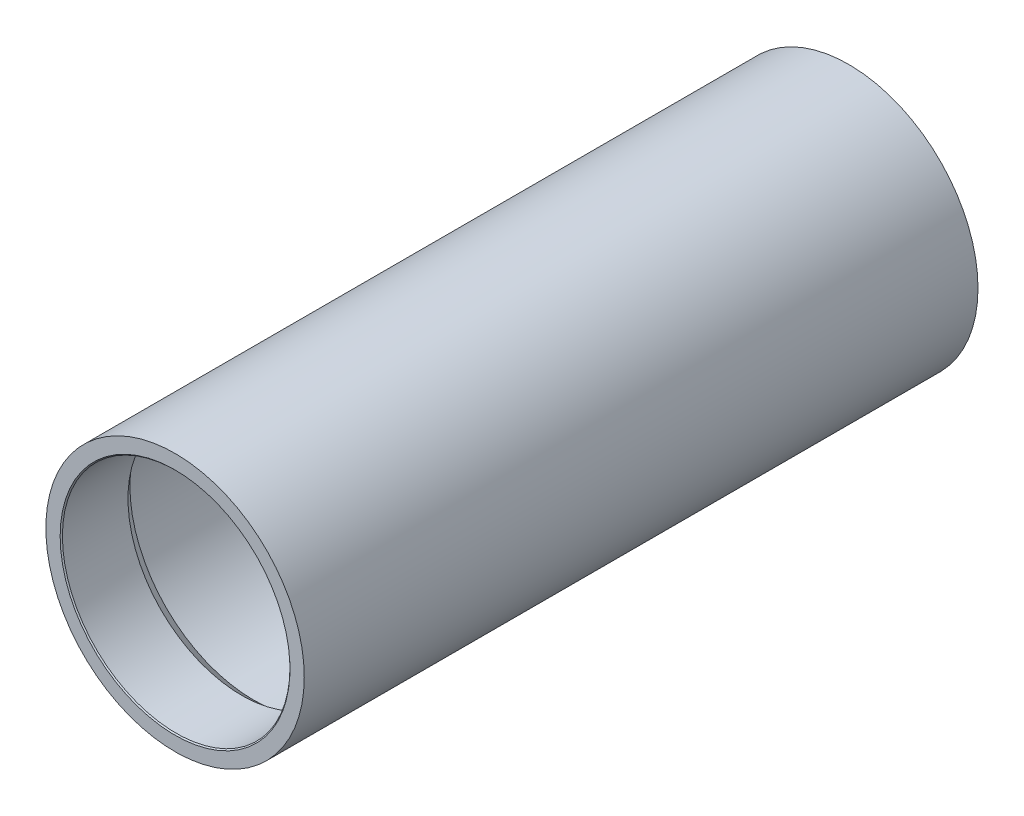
ISO-10303-21;
HEADER;
FILE_DESCRIPTION(('STEP AP214'),'2;1');
FILE_NAME('part.step','',(''),(''),'','','');
FILE_SCHEMA(('AUTOMOTIVE_DESIGN { 1 0 10303 214 1 1 1 1 }'));
ENDSEC;
DATA;
#1=APPLICATION_CONTEXT('core data for automotive mechanical design processes');
#2=APPLICATION_PROTOCOL_DEFINITION('international standard','automotive_design',2000,#1);
#3=PRODUCT_CONTEXT('',#1,'mechanical');
#4=PRODUCT('Part','Part','',(#3));
#5=PRODUCT_RELATED_PRODUCT_CATEGORY('part','',(#4));
#6=PRODUCT_DEFINITION_FORMATION('','',#4);
#7=PRODUCT_DEFINITION_CONTEXT('part definition',#1,'design');
#8=PRODUCT_DEFINITION('design','',#6,#7);
#9=PRODUCT_DEFINITION_SHAPE('','',#8);
#10=(LENGTH_UNIT() NAMED_UNIT(*) SI_UNIT(.MILLI.,.METRE.));
#11=(NAMED_UNIT(*) PLANE_ANGLE_UNIT() SI_UNIT($,.RADIAN.));
#12=(NAMED_UNIT(*) SI_UNIT($,.STERADIAN.) SOLID_ANGLE_UNIT());
#13=UNCERTAINTY_MEASURE_WITH_UNIT(LENGTH_MEASURE(1.E-05),#10,'distance_accuracy_value','');
#14=(GEOMETRIC_REPRESENTATION_CONTEXT(3) GLOBAL_UNCERTAINTY_ASSIGNED_CONTEXT((#13)) GLOBAL_UNIT_ASSIGNED_CONTEXT((#10,
#11,#12)) REPRESENTATION_CONTEXT('',''));
#15=CARTESIAN_POINT('',(0.,0.,0.));
#16=DIRECTION('',(0.,0.,1.));
#17=DIRECTION('',(1.,0.,0.));
#18=AXIS2_PLACEMENT_3D('',#15,#16,#17);
#19=CARTESIAN_POINT('',(0.,0.,0.));
#20=DIRECTION('',(0.,0.,1.));
#21=DIRECTION('',(1.,0.,0.));
#22=AXIS2_PLACEMENT_3D('',#19,#20,#21);
#23=CYLINDRICAL_SURFACE('',#22,57.15);
#24=CARTESIAN_POINT('',(0.,0.,0.));
#25=DIRECTION('',(0.,0.,1.));
#26=DIRECTION('',(1.,0.,0.));
#27=AXIS2_PLACEMENT_3D('',#24,#25,#26);
#28=CIRCLE('',#27,57.15);
#29=CARTESIAN_POINT('',(57.15,0.,0.));
#30=VERTEX_POINT('',#29);
#31=EDGE_CURVE('E59',#30,#30,#28,.T.);
#32=ORIENTED_EDGE('',*,*,#31,.F.);
#33=EDGE_LOOP('',(#32));
#34=FACE_BOUND('',#33,.T.);
#35=CARTESIAN_POINT('',(0.,0.,-298.));
#36=DIRECTION('',(0.,0.,1.));
#37=DIRECTION('',(1.,0.,0.));
#38=AXIS2_PLACEMENT_3D('',#35,#36,#37);
#39=CIRCLE('',#38,57.15);
#40=CARTESIAN_POINT('',(57.15,0.,-298.));
#41=VERTEX_POINT('',#40);
#42=EDGE_CURVE('E78',#41,#41,#39,.T.);
#43=ORIENTED_EDGE('',*,*,#42,.T.);
#44=EDGE_LOOP('',(#43));
#45=FACE_BOUND('',#44,.T.);
#46=ADVANCED_FACE('F34',(#34,#45),#23,.T.);
#47=CARTESIAN_POINT('',(0.,57.15,0.));
#48=DIRECTION('',(0.,0.,-1.));
#49=DIRECTION('',(-1.,0.,0.));
#50=AXIS2_PLACEMENT_3D('',#47,#48,#49);
#51=PLANE('',#50);
#52=CARTESIAN_POINT('',(0.,0.,0.));
#53=DIRECTION('',(0.,0.,-1.));
#54=DIRECTION('',(-1.,0.,0.));
#55=AXIS2_PLACEMENT_3D('',#52,#53,#54);
#56=CIRCLE('',#55,50.825);
#57=CARTESIAN_POINT('',(-50.825,0.,0.));
#58=VERTEX_POINT('',#57);
#59=EDGE_CURVE('E10',#58,#58,#56,.T.);
#60=ORIENTED_EDGE('',*,*,#59,.T.);
#61=EDGE_LOOP('',(#60));
#62=FACE_BOUND('',#61,.T.);
#63=ORIENTED_EDGE('',*,*,#31,.T.);
#64=EDGE_LOOP('',(#63));
#65=FACE_BOUND('',#64,.T.);
#66=ADVANCED_FACE('F99',(#62,#65),#51,.F.);
#67=CARTESIAN_POINT('',(0.,0.,0.));
#68=DIRECTION('',(0.,0.,1.));
#69=DIRECTION('',(1.,0.,0.));
#70=AXIS2_PLACEMENT_3D('',#67,#68,#69);
#71=CYLINDRICAL_SURFACE('',#70,50.325);
#72=CARTESIAN_POINT('',(0.,0.,-0.500000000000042));
#73=DIRECTION('',(0.,0.,-1.));
#74=DIRECTION('',(-1.,0.,0.));
#75=AXIS2_PLACEMENT_3D('',#72,#73,#74);
#76=CIRCLE('',#75,50.325);
#77=CARTESIAN_POINT('',(-50.325,0.,-0.500000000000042));
#78=VERTEX_POINT('',#77);
#79=EDGE_CURVE('E42',#78,#78,#76,.F.);
#80=ORIENTED_EDGE('',*,*,#79,.T.);
#81=EDGE_LOOP('',(#80));
#82=FACE_BOUND('',#81,.T.);
#83=CARTESIAN_POINT('',(0.,0.,-29.5));
#84=DIRECTION('',(0.,0.,1.));
#85=DIRECTION('',(1.,0.,0.));
#86=AXIS2_PLACEMENT_3D('',#83,#84,#85);
#87=CIRCLE('',#86,50.325);
#88=CARTESIAN_POINT('',(50.325,0.,-29.5));
#89=VERTEX_POINT('',#88);
#90=EDGE_CURVE('E63',#89,#89,#87,.T.);
#91=ORIENTED_EDGE('',*,*,#90,.F.);
#92=EDGE_LOOP('',(#91));
#93=FACE_BOUND('',#92,.T.);
#94=ADVANCED_FACE('F105',(#82,#93),#71,.F.);
#95=CARTESIAN_POINT('',(0.,0.,-29.5));
#96=DIRECTION('',(0.,0.,-1.));
#97=DIRECTION('',(-1.,0.,0.));
#98=AXIS2_PLACEMENT_3D('',#95,#96,#97);
#99=CONICAL_SURFACE('',#98,50.325,0.698131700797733);
#100=CARTESIAN_POINT('',(0.,0.,-34.7735096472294));
#101=DIRECTION('',(0.,0.,1.));
#102=DIRECTION('',(1.,0.,0.));
#103=AXIS2_PLACEMENT_3D('',#100,#101,#102);
#104=CIRCLE('',#103,54.75);
#105=CARTESIAN_POINT('',(54.75,0.,-34.7735096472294));
#106=VERTEX_POINT('',#105);
#107=EDGE_CURVE('E67',#106,#106,#104,.T.);
#108=ORIENTED_EDGE('',*,*,#107,.F.);
#109=EDGE_LOOP('',(#108));
#110=FACE_BOUND('',#109,.T.);
#111=ORIENTED_EDGE('',*,*,#90,.T.);
#112=EDGE_LOOP('',(#111));
#113=FACE_BOUND('',#112,.T.);
#114=ADVANCED_FACE('F111',(#110,#113),#99,.F.);
#115=CARTESIAN_POINT('',(0.,0.,0.));
#116=DIRECTION('',(0.,0.,1.));
#117=DIRECTION('',(1.,0.,0.));
#118=AXIS2_PLACEMENT_3D('',#115,#116,#117);
#119=CYLINDRICAL_SURFACE('',#118,54.75);
#120=CARTESIAN_POINT('',(0.,0.,-263.226490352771));
#121=DIRECTION('',(0.,0.,1.));
#122=DIRECTION('',(1.,0.,0.));
#123=AXIS2_PLACEMENT_3D('',#120,#121,#122);
#124=CIRCLE('',#123,54.75);
#125=CARTESIAN_POINT('',(54.75,0.,-263.226490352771));
#126=VERTEX_POINT('',#125);
#127=EDGE_CURVE('E71',#126,#126,#124,.T.);
#128=ORIENTED_EDGE('',*,*,#127,.F.);
#129=EDGE_LOOP('',(#128));
#130=FACE_BOUND('',#129,.T.);
#131=ORIENTED_EDGE('',*,*,#107,.T.);
#132=EDGE_LOOP('',(#131));
#133=FACE_BOUND('',#132,.T.);
#134=ADVANCED_FACE('F114',(#130,#133),#119,.F.);
#135=CARTESIAN_POINT('',(0.,0.,-263.226490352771));
#136=DIRECTION('',(0.,0.,1.));
#137=DIRECTION('',(1.,0.,0.));
#138=AXIS2_PLACEMENT_3D('',#135,#136,#137);
#139=CONICAL_SURFACE('',#138,54.75,0.698131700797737);
#140=CARTESIAN_POINT('',(0.,0.,-268.5));
#141=DIRECTION('',(0.,0.,1.));
#142=DIRECTION('',(1.,0.,0.));
#143=AXIS2_PLACEMENT_3D('',#140,#141,#142);
#144=CIRCLE('',#143,50.325);
#145=CARTESIAN_POINT('',(50.325,0.,-268.5));
#146=VERTEX_POINT('',#145);
#147=EDGE_CURVE('E75',#146,#146,#144,.T.);
#148=ORIENTED_EDGE('',*,*,#147,.F.);
#149=EDGE_LOOP('',(#148));
#150=FACE_BOUND('',#149,.T.);
#151=ORIENTED_EDGE('',*,*,#127,.T.);
#152=EDGE_LOOP('',(#151));
#153=FACE_BOUND('',#152,.T.);
#154=ADVANCED_FACE('F95',(#150,#153),#139,.F.);
#155=CARTESIAN_POINT('',(0.,0.,0.));
#156=DIRECTION('',(0.,0.,1.));
#157=DIRECTION('',(1.,0.,0.));
#158=AXIS2_PLACEMENT_3D('',#155,#156,#157);
#159=CYLINDRICAL_SURFACE('',#158,50.325);
#160=CARTESIAN_POINT('',(0.,0.,-297.5));
#161=DIRECTION('',(0.,0.,1.));
#162=DIRECTION('',(1.,0.,0.));
#163=AXIS2_PLACEMENT_3D('',#160,#161,#162);
#164=CIRCLE('',#163,50.325);
#165=CARTESIAN_POINT('',(50.325,0.,-297.5));
#166=VERTEX_POINT('',#165);
#167=EDGE_CURVE('E48',#166,#166,#164,.F.);
#168=ORIENTED_EDGE('',*,*,#167,.T.);
#169=EDGE_LOOP('',(#168));
#170=FACE_BOUND('',#169,.T.);
#171=ORIENTED_EDGE('',*,*,#147,.T.);
#172=EDGE_LOOP('',(#171));
#173=FACE_BOUND('',#172,.T.);
#174=ADVANCED_FACE('F87',(#170,#173),#159,.F.);
#175=CARTESIAN_POINT('',(0.,50.325,-298.));
#176=DIRECTION('',(0.,0.,1.));
#177=DIRECTION('',(1.,0.,0.));
#178=AXIS2_PLACEMENT_3D('',#175,#176,#177);
#179=PLANE('',#178);
#180=CARTESIAN_POINT('',(0.,0.,-298.));
#181=DIRECTION('',(0.,0.,1.));
#182=DIRECTION('',(1.,0.,0.));
#183=AXIS2_PLACEMENT_3D('',#180,#181,#182);
#184=CIRCLE('',#183,50.825);
#185=CARTESIAN_POINT('',(50.825,0.,-298.));
#186=VERTEX_POINT('',#185);
#187=EDGE_CURVE('E53',#186,#186,#184,.T.);
#188=ORIENTED_EDGE('',*,*,#187,.T.);
#189=EDGE_LOOP('',(#188));
#190=FACE_BOUND('',#189,.T.);
#191=ORIENTED_EDGE('',*,*,#42,.F.);
#192=EDGE_LOOP('',(#191));
#193=FACE_BOUND('',#192,.T.);
#194=ADVANCED_FACE('F84',(#190,#193),#179,.F.);
#195=CARTESIAN_POINT('',(0.,0.,-298.));
#196=DIRECTION('',(0.,0.,-1.));
#197=DIRECTION('',(-1.,0.,0.));
#198=AXIS2_PLACEMENT_3D('',#195,#196,#197);
#199=CONICAL_SURFACE('',#198,50.825,0.785398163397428);
#200=ORIENTED_EDGE('',*,*,#167,.F.);
#201=EDGE_LOOP('',(#200));
#202=FACE_BOUND('',#201,.T.);
#203=ORIENTED_EDGE('',*,*,#187,.F.);
#204=EDGE_LOOP('',(#203));
#205=FACE_BOUND('',#204,.T.);
#206=ADVANCED_FACE('F86',(#202,#205),#199,.F.);
#207=CARTESIAN_POINT('',(0.,0.,-0.500000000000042));
#208=DIRECTION('',(0.,0.,1.));
#209=DIRECTION('',(1.,0.,0.));
#210=AXIS2_PLACEMENT_3D('',#207,#208,#209);
#211=CONICAL_SURFACE('',#210,50.325,0.785398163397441);
#212=ORIENTED_EDGE('',*,*,#59,.F.);
#213=EDGE_LOOP('',(#212));
#214=FACE_BOUND('',#213,.T.);
#215=ORIENTED_EDGE('',*,*,#79,.F.);
#216=EDGE_LOOP('',(#215));
#217=FACE_BOUND('',#216,.T.);
#218=ADVANCED_FACE('F36',(#214,#217),#211,.F.);
#219=CLOSED_SHELL('',(#46,#66,#94,#114,#134,#154,#174,#194,#206,#218));
#220=MANIFOLD_SOLID_BREP('B2',#219);
#221=ADVANCED_BREP_SHAPE_REPRESENTATION('',(#18,#220),#14);
#222=SHAPE_DEFINITION_REPRESENTATION(#9,#221);
ENDSEC;
END-ISO-10303-21;
